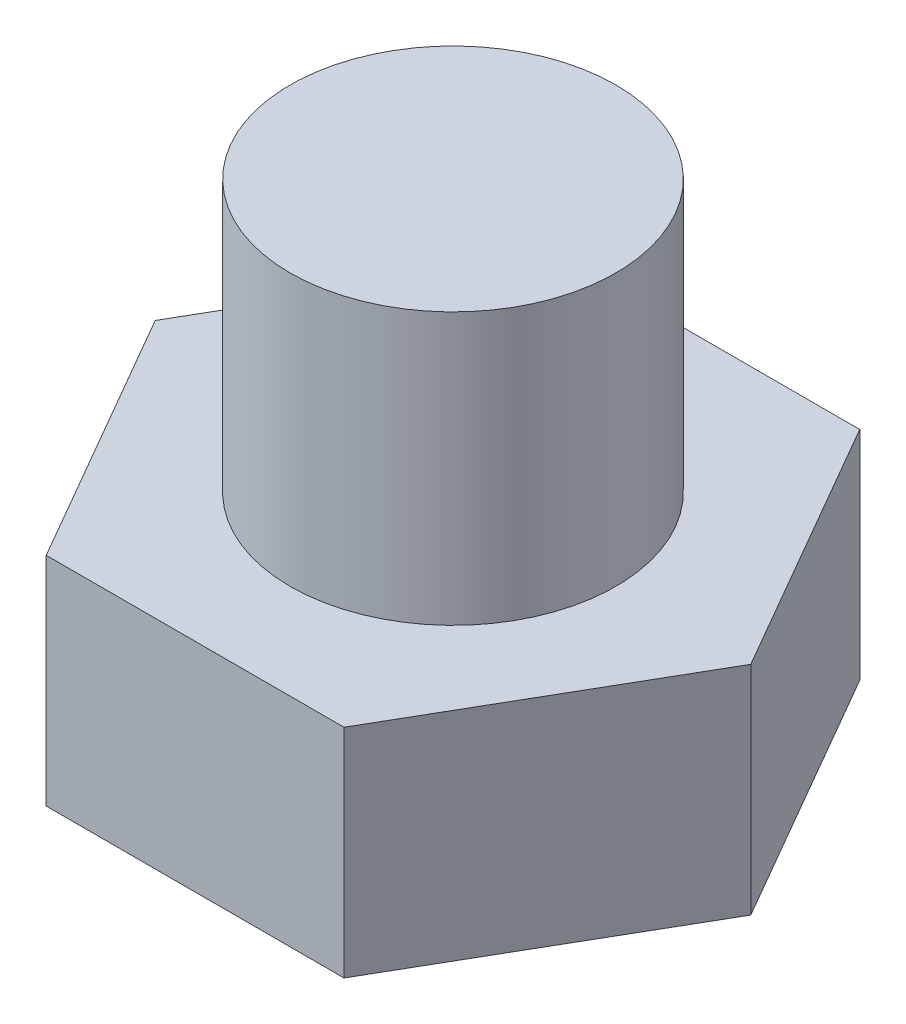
ISO-10303-21;
HEADER;
FILE_DESCRIPTION(('STEP AP214'),'2;1');
FILE_NAME('part.step','',(''),(''),'','','');
FILE_SCHEMA(('AUTOMOTIVE_DESIGN { 1 0 10303 214 1 1 1 1 }'));
ENDSEC;
DATA;
#1=APPLICATION_CONTEXT('core data for automotive mechanical design processes');
#2=APPLICATION_PROTOCOL_DEFINITION('international standard','automotive_design',2000,#1);
#3=PRODUCT_CONTEXT('',#1,'mechanical');
#4=PRODUCT('Part','Part','',(#3));
#5=PRODUCT_RELATED_PRODUCT_CATEGORY('part','',(#4));
#6=PRODUCT_DEFINITION_FORMATION('','',#4);
#7=PRODUCT_DEFINITION_CONTEXT('part definition',#1,'design');
#8=PRODUCT_DEFINITION('design','',#6,#7);
#9=PRODUCT_DEFINITION_SHAPE('','',#8);
#10=(LENGTH_UNIT() NAMED_UNIT(*) SI_UNIT(.MILLI.,.METRE.));
#11=(NAMED_UNIT(*) PLANE_ANGLE_UNIT() SI_UNIT($,.RADIAN.));
#12=(NAMED_UNIT(*) SI_UNIT($,.STERADIAN.) SOLID_ANGLE_UNIT());
#13=UNCERTAINTY_MEASURE_WITH_UNIT(LENGTH_MEASURE(1.E-05),#10,'distance_accuracy_value','');
#14=(GEOMETRIC_REPRESENTATION_CONTEXT(3) GLOBAL_UNCERTAINTY_ASSIGNED_CONTEXT((#13)) GLOBAL_UNIT_ASSIGNED_CONTEXT((#10,
#11,#12)) REPRESENTATION_CONTEXT('',''));
#15=CARTESIAN_POINT('',(0.,0.,0.));
#16=DIRECTION('',(0.,0.,1.));
#17=DIRECTION('',(1.,0.,0.));
#18=AXIS2_PLACEMENT_3D('',#15,#16,#17);
#19=CARTESIAN_POINT('',(10.9696551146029,8.,0.));
#20=DIRECTION('',(-0.866025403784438,0.,0.5));
#21=DIRECTION('',(0.5,0.,0.866025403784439));
#22=AXIS2_PLACEMENT_3D('',#19,#20,#21);
#23=PLANE('',#22);
#24=DIRECTION('',(-0.5,0.,-0.866025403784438));
#25=VECTOR('',#24,1.);
#26=CARTESIAN_POINT('',(10.9696551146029,0.,0.));
#27=LINE('',#26,#25);
#28=CARTESIAN_POINT('',(10.9696551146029,0.,0.));
#29=VERTEX_POINT('',#28);
#30=CARTESIAN_POINT('',(5.48482755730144,0.,-9.5));
#31=VERTEX_POINT('',#30);
#32=EDGE_CURVE('E136',#29,#31,#27,.T.);
#33=ORIENTED_EDGE('',*,*,#32,.T.);
#34=DIRECTION('',(0.,-1.,0.));
#35=VECTOR('',#34,1.);
#36=CARTESIAN_POINT('',(5.48482755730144,8.,-9.5));
#37=LINE('',#36,#35);
#38=CARTESIAN_POINT('',(5.48482755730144,8.,-9.5));
#39=VERTEX_POINT('',#38);
#40=EDGE_CURVE('E48',#39,#31,#37,.T.);
#41=ORIENTED_EDGE('',*,*,#40,.F.);
#42=DIRECTION('',(-0.5,0.,-0.866025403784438));
#43=VECTOR('',#42,1.);
#44=CARTESIAN_POINT('',(10.9696551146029,8.,0.));
#45=LINE('',#44,#43);
#46=CARTESIAN_POINT('',(10.9696551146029,8.,0.));
#47=VERTEX_POINT('',#46);
#48=EDGE_CURVE('E153',#47,#39,#45,.T.);
#49=ORIENTED_EDGE('',*,*,#48,.F.);
#50=DIRECTION('',(0.,-1.,0.));
#51=VECTOR('',#50,1.);
#52=CARTESIAN_POINT('',(10.9696551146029,8.,0.));
#53=LINE('',#52,#51);
#54=EDGE_CURVE('E132',#47,#29,#53,.T.);
#55=ORIENTED_EDGE('',*,*,#54,.T.);
#56=EDGE_LOOP('',(#33,#41,#49,#55));
#57=FACE_BOUND('',#56,.T.);
#58=ADVANCED_FACE('F45',(#57),#23,.F.);
#59=CARTESIAN_POINT('',(5.48482755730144,8.,-9.5));
#60=DIRECTION('',(0.,0.,1.));
#61=DIRECTION('',(1.,0.,0.));
#62=AXIS2_PLACEMENT_3D('',#59,#60,#61);
#63=PLANE('',#62);
#64=DIRECTION('',(-1.,0.,0.));
#65=VECTOR('',#64,1.);
#66=CARTESIAN_POINT('',(5.48482755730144,0.,-9.5));
#67=LINE('',#66,#65);
#68=CARTESIAN_POINT('',(-5.48482755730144,0.,-9.5));
#69=VERTEX_POINT('',#68);
#70=EDGE_CURVE('E140',#31,#69,#67,.T.);
#71=ORIENTED_EDGE('',*,*,#70,.T.);
#72=DIRECTION('',(0.,-1.,0.));
#73=VECTOR('',#72,1.);
#74=CARTESIAN_POINT('',(-5.48482755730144,8.,-9.5));
#75=LINE('',#74,#73);
#76=CARTESIAN_POINT('',(-5.48482755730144,8.,-9.5));
#77=VERTEX_POINT('',#76);
#78=EDGE_CURVE('E159',#77,#69,#75,.T.);
#79=ORIENTED_EDGE('',*,*,#78,.F.);
#80=DIRECTION('',(-1.,0.,0.));
#81=VECTOR('',#80,1.);
#82=CARTESIAN_POINT('',(5.48482755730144,8.,-9.5));
#83=LINE('',#82,#81);
#84=EDGE_CURVE('E101',#39,#77,#83,.T.);
#85=ORIENTED_EDGE('',*,*,#84,.F.);
#86=ORIENTED_EDGE('',*,*,#40,.T.);
#87=EDGE_LOOP('',(#71,#79,#85,#86));
#88=FACE_BOUND('',#87,.T.);
#89=ADVANCED_FACE('F166',(#88),#63,.F.);
#90=CARTESIAN_POINT('',(-5.48482755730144,8.,-9.5));
#91=DIRECTION('',(0.866025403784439,0.,0.5));
#92=DIRECTION('',(0.5,0.,-0.866025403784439));
#93=AXIS2_PLACEMENT_3D('',#90,#91,#92);
#94=PLANE('',#93);
#95=DIRECTION('',(-0.5,0.,0.866025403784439));
#96=VECTOR('',#95,1.);
#97=CARTESIAN_POINT('',(-5.48482755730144,0.,-9.5));
#98=LINE('',#97,#96);
#99=CARTESIAN_POINT('',(-10.9696551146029,0.,0.));
#100=VERTEX_POINT('',#99);
#101=EDGE_CURVE('E144',#69,#100,#98,.T.);
#102=ORIENTED_EDGE('',*,*,#101,.T.);
#103=DIRECTION('',(0.,-1.,0.));
#104=VECTOR('',#103,1.);
#105=CARTESIAN_POINT('',(-10.9696551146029,8.,0.));
#106=LINE('',#105,#104);
#107=CARTESIAN_POINT('',(-10.9696551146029,8.,0.));
#108=VERTEX_POINT('',#107);
#109=EDGE_CURVE('E125',#108,#100,#106,.T.);
#110=ORIENTED_EDGE('',*,*,#109,.F.);
#111=DIRECTION('',(-0.5,0.,0.866025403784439));
#112=VECTOR('',#111,1.);
#113=CARTESIAN_POINT('',(-5.48482755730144,8.,-9.5));
#114=LINE('',#113,#112);
#115=EDGE_CURVE('E114',#77,#108,#114,.T.);
#116=ORIENTED_EDGE('',*,*,#115,.F.);
#117=ORIENTED_EDGE('',*,*,#78,.T.);
#118=EDGE_LOOP('',(#102,#110,#116,#117));
#119=FACE_BOUND('',#118,.T.);
#120=ADVANCED_FACE('F172',(#119),#94,.F.);
#121=CARTESIAN_POINT('',(-10.9696551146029,8.,0.));
#122=DIRECTION('',(0.866025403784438,0.,-0.5));
#123=DIRECTION('',(-0.5,0.,-0.866025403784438));
#124=AXIS2_PLACEMENT_3D('',#121,#122,#123);
#125=PLANE('',#124);
#126=DIRECTION('',(0.5,0.,0.866025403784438));
#127=VECTOR('',#126,1.);
#128=CARTESIAN_POINT('',(-10.9696551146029,0.,0.));
#129=LINE('',#128,#127);
#130=CARTESIAN_POINT('',(-5.48482755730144,0.,9.5));
#131=VERTEX_POINT('',#130);
#132=EDGE_CURVE('E123',#100,#131,#129,.T.);
#133=ORIENTED_EDGE('',*,*,#132,.T.);
#134=DIRECTION('',(0.,-1.,0.));
#135=VECTOR('',#134,1.);
#136=CARTESIAN_POINT('',(-5.48482755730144,8.,9.5));
#137=LINE('',#136,#135);
#138=CARTESIAN_POINT('',(-5.48482755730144,8.,9.5));
#139=VERTEX_POINT('',#138);
#140=EDGE_CURVE('E120',#139,#131,#137,.T.);
#141=ORIENTED_EDGE('',*,*,#140,.F.);
#142=DIRECTION('',(0.5,0.,0.866025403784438));
#143=VECTOR('',#142,1.);
#144=CARTESIAN_POINT('',(-10.9696551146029,8.,0.));
#145=LINE('',#144,#143);
#146=EDGE_CURVE('E108',#108,#139,#145,.T.);
#147=ORIENTED_EDGE('',*,*,#146,.F.);
#148=ORIENTED_EDGE('',*,*,#109,.T.);
#149=EDGE_LOOP('',(#133,#141,#147,#148));
#150=FACE_BOUND('',#149,.T.);
#151=ADVANCED_FACE('F121',(#150),#125,.F.);
#152=CARTESIAN_POINT('',(-5.48482755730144,8.,9.5));
#153=DIRECTION('',(0.,0.,-1.));
#154=DIRECTION('',(-1.,0.,0.));
#155=AXIS2_PLACEMENT_3D('',#152,#153,#154);
#156=PLANE('',#155);
#157=DIRECTION('',(1.,0.,0.));
#158=VECTOR('',#157,1.);
#159=CARTESIAN_POINT('',(-5.48482755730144,0.,9.5));
#160=LINE('',#159,#158);
#161=CARTESIAN_POINT('',(5.48482755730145,0.,9.5));
#162=VERTEX_POINT('',#161);
#163=EDGE_CURVE('E86',#131,#162,#160,.T.);
#164=ORIENTED_EDGE('',*,*,#163,.T.);
#165=DIRECTION('',(0.,-1.,0.));
#166=VECTOR('',#165,1.);
#167=CARTESIAN_POINT('',(5.48482755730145,8.,9.5));
#168=LINE('',#167,#166);
#169=CARTESIAN_POINT('',(5.48482755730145,8.,9.5));
#170=VERTEX_POINT('',#169);
#171=EDGE_CURVE('E126',#170,#162,#168,.T.);
#172=ORIENTED_EDGE('',*,*,#171,.F.);
#173=DIRECTION('',(1.,0.,0.));
#174=VECTOR('',#173,1.);
#175=CARTESIAN_POINT('',(-5.48482755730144,8.,9.5));
#176=LINE('',#175,#174);
#177=EDGE_CURVE('E112',#139,#170,#176,.T.);
#178=ORIENTED_EDGE('',*,*,#177,.F.);
#179=ORIENTED_EDGE('',*,*,#140,.T.);
#180=EDGE_LOOP('',(#164,#172,#178,#179));
#181=FACE_BOUND('',#180,.T.);
#182=ADVANCED_FACE('F128',(#181),#156,.F.);
#183=CARTESIAN_POINT('',(5.48482755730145,8.,9.5));
#184=DIRECTION('',(-0.866025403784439,0.,-0.5));
#185=DIRECTION('',(-0.5,0.,0.866025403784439));
#186=AXIS2_PLACEMENT_3D('',#183,#184,#185);
#187=PLANE('',#186);
#188=DIRECTION('',(0.5,0.,-0.866025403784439));
#189=VECTOR('',#188,1.);
#190=CARTESIAN_POINT('',(5.48482755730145,0.,9.5));
#191=LINE('',#190,#189);
#192=EDGE_CURVE('E92',#162,#29,#191,.T.);
#193=ORIENTED_EDGE('',*,*,#192,.T.);
#194=ORIENTED_EDGE('',*,*,#54,.F.);
#195=DIRECTION('',(0.5,0.,-0.866025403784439));
#196=VECTOR('',#195,1.);
#197=CARTESIAN_POINT('',(5.48482755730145,8.,9.5));
#198=LINE('',#197,#196);
#199=EDGE_CURVE('E63',#170,#47,#198,.T.);
#200=ORIENTED_EDGE('',*,*,#199,.F.);
#201=ORIENTED_EDGE('',*,*,#171,.T.);
#202=EDGE_LOOP('',(#193,#194,#200,#201));
#203=FACE_BOUND('',#202,.T.);
#204=ADVANCED_FACE('F192',(#203),#187,.F.);
#205=CARTESIAN_POINT('',(0.,8.,0.));
#206=DIRECTION('',(0.,1.,0.));
#207=DIRECTION('',(0.,0.,1.));
#208=AXIS2_PLACEMENT_3D('',#205,#206,#207);
#209=PLANE('',#208);
#210=CARTESIAN_POINT('',(0.,8.,0.));
#211=DIRECTION('',(0.,1.,0.));
#212=DIRECTION('',(0.,0.,1.));
#213=AXIS2_PLACEMENT_3D('',#210,#211,#212);
#214=CIRCLE('',#213,6.);
#215=CARTESIAN_POINT('',(0.,8.,6.));
#216=VERTEX_POINT('',#215);
#217=EDGE_CURVE('E11',#216,#216,#214,.T.);
#218=ORIENTED_EDGE('',*,*,#217,.F.);
#219=EDGE_LOOP('',(#218));
#220=FACE_BOUND('',#219,.T.);
#221=ORIENTED_EDGE('',*,*,#48,.T.);
#222=ORIENTED_EDGE('',*,*,#84,.T.);
#223=ORIENTED_EDGE('',*,*,#115,.T.);
#224=ORIENTED_EDGE('',*,*,#146,.T.);
#225=ORIENTED_EDGE('',*,*,#177,.T.);
#226=ORIENTED_EDGE('',*,*,#199,.T.);
#227=EDGE_LOOP('',(#221,#222,#223,#224,#225,#226));
#228=FACE_BOUND('',#227,.T.);
#229=ADVANCED_FACE('F110',(#220,#228),#209,.T.);
#230=CARTESIAN_POINT('',(0.,0.,0.));
#231=DIRECTION('',(0.,1.,0.));
#232=DIRECTION('',(0.,0.,1.));
#233=AXIS2_PLACEMENT_3D('',#230,#231,#232);
#234=PLANE('',#233);
#235=ORIENTED_EDGE('',*,*,#32,.F.);
#236=ORIENTED_EDGE('',*,*,#192,.F.);
#237=ORIENTED_EDGE('',*,*,#163,.F.);
#238=ORIENTED_EDGE('',*,*,#132,.F.);
#239=ORIENTED_EDGE('',*,*,#101,.F.);
#240=ORIENTED_EDGE('',*,*,#70,.F.);
#241=EDGE_LOOP('',(#235,#236,#237,#238,#239,#240));
#242=FACE_BOUND('',#241,.T.);
#243=ADVANCED_FACE('F171',(#242),#234,.F.);
#244=CARTESIAN_POINT('',(0.,18.,0.));
#245=DIRECTION('',(0.,-1.,0.));
#246=DIRECTION('',(0.,0.,-1.));
#247=AXIS2_PLACEMENT_3D('',#244,#245,#246);
#248=CYLINDRICAL_SURFACE('',#247,6.);
#249=CARTESIAN_POINT('',(0.,18.,0.));
#250=DIRECTION('',(0.,1.,0.));
#251=DIRECTION('',(0.,0.,1.));
#252=AXIS2_PLACEMENT_3D('',#249,#250,#251);
#253=CIRCLE('',#252,6.);
#254=CARTESIAN_POINT('',(0.,18.,6.));
#255=VERTEX_POINT('',#254);
#256=EDGE_CURVE('E141',#255,#255,#253,.T.);
#257=ORIENTED_EDGE('',*,*,#256,.F.);
#258=EDGE_LOOP('',(#257));
#259=FACE_BOUND('',#258,.T.);
#260=ORIENTED_EDGE('',*,*,#217,.T.);
#261=EDGE_LOOP('',(#260));
#262=FACE_BOUND('',#261,.T.);
#263=ADVANCED_FACE('F185',(#259,#262),#248,.T.);
#264=CARTESIAN_POINT('',(0.,18.,0.));
#265=DIRECTION('',(0.,1.,0.));
#266=DIRECTION('',(0.,0.,1.));
#267=AXIS2_PLACEMENT_3D('',#264,#265,#266);
#268=PLANE('',#267);
#269=ORIENTED_EDGE('',*,*,#256,.T.);
#270=EDGE_LOOP('',(#269));
#271=FACE_BOUND('',#270,.T.);
#272=ADVANCED_FACE('F183',(#271),#268,.T.);
#273=CLOSED_SHELL('',(#58,#89,#120,#151,#182,#204,#229,#243,#263,#272));
#274=MANIFOLD_SOLID_BREP('B2',#273);
#275=ADVANCED_BREP_SHAPE_REPRESENTATION('',(#18,#274),#14);
#276=SHAPE_DEFINITION_REPRESENTATION(#9,#275);
ENDSEC;
END-ISO-10303-21;
